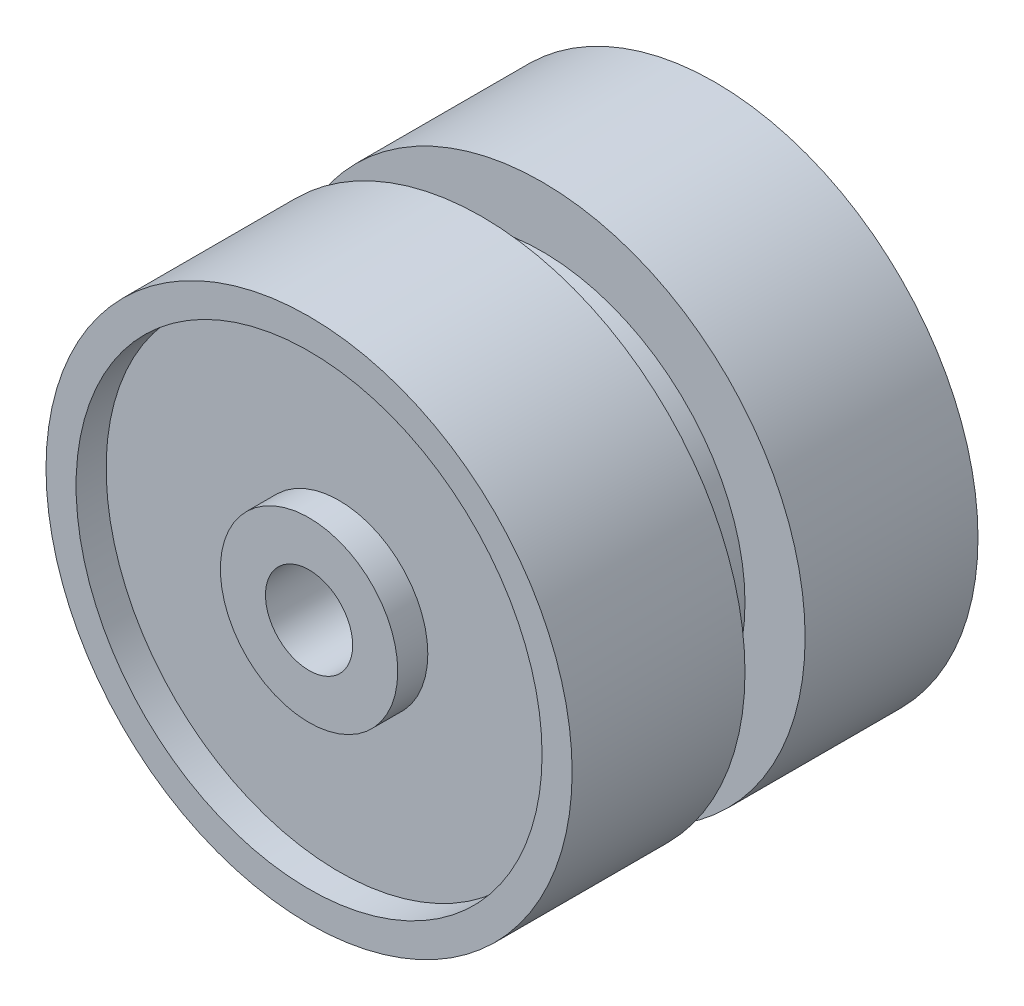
from build123d import *

# Parameters (mm, degrees)
ESQUISSE3_R             = 7.75
ESQUISSE3_R_2           = 2.95
ENL_V_MAT_EXTRU_1_DEPTH = 1


with BuildPart() as part:
    # Esquisse2 → R_volution1 (revolve)
    with BuildSketch(Plane(origin=(0, 0, 0), x_dir=(0, 0, -1), z_dir=(1, 0, 0)), mode=Mode.PRIVATE) as r_volution1_sk:
        Polygon((-6.75, 8.75), (-6.75, 1.45), (6.75, 1.45), (6.75, 8.75), (1, 8.75), (1, 6.75), (-1, 6.75), (-1, 8.75), align=None)
    revolve(r_volution1_sk.sketch.rotate(Axis((0, 0, 15.787769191), (0, 0, -1)), 90), axis=Axis((0, 0, 15.787769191), (0, 0, -1)))

    # Esquisse3 → Enl_v. mat.-Extru.1 (cut)
    with BuildSketch(Plane.XY.offset(6.75)):
        Circle(ESQUISSE3_R)
        Circle(ESQUISSE3_R_2, mode=Mode.SUBTRACT)
    extrude(amount=-ENL_V_MAT_EXTRU_1_DEPTH, mode=Mode.SUBTRACT)


solid = part.part
